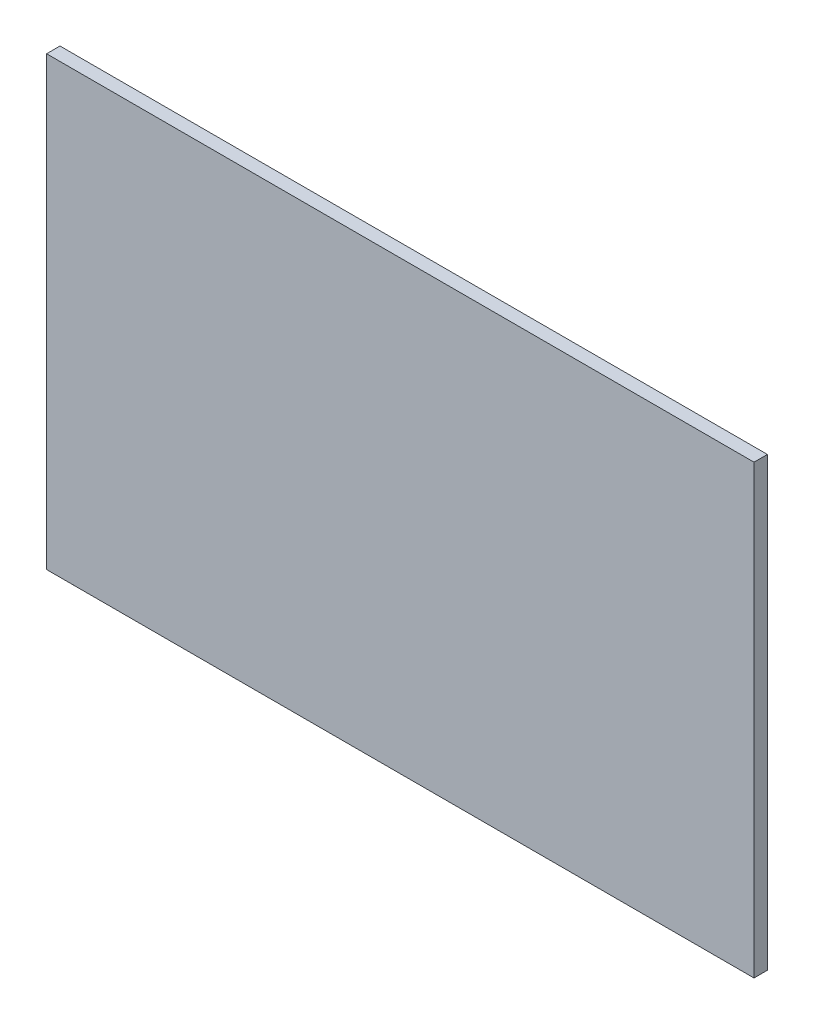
ISO-10303-21;
HEADER;
FILE_DESCRIPTION(('STEP AP214'),'2;1');
FILE_NAME('part.step','',(''),(''),'','','');
FILE_SCHEMA(('AUTOMOTIVE_DESIGN { 1 0 10303 214 1 1 1 1 }'));
ENDSEC;
DATA;
#1=APPLICATION_CONTEXT('core data for automotive mechanical design processes');
#2=APPLICATION_PROTOCOL_DEFINITION('international standard','automotive_design',2000,#1);
#3=PRODUCT_CONTEXT('',#1,'mechanical');
#4=PRODUCT('Part','Part','',(#3));
#5=PRODUCT_RELATED_PRODUCT_CATEGORY('part','',(#4));
#6=PRODUCT_DEFINITION_FORMATION('','',#4);
#7=PRODUCT_DEFINITION_CONTEXT('part definition',#1,'design');
#8=PRODUCT_DEFINITION('design','',#6,#7);
#9=PRODUCT_DEFINITION_SHAPE('','',#8);
#10=(LENGTH_UNIT() NAMED_UNIT(*) SI_UNIT(.MILLI.,.METRE.));
#11=(NAMED_UNIT(*) PLANE_ANGLE_UNIT() SI_UNIT($,.RADIAN.));
#12=(NAMED_UNIT(*) SI_UNIT($,.STERADIAN.) SOLID_ANGLE_UNIT());
#13=UNCERTAINTY_MEASURE_WITH_UNIT(LENGTH_MEASURE(1.E-05),#10,'distance_accuracy_value','');
#14=(GEOMETRIC_REPRESENTATION_CONTEXT(3) GLOBAL_UNCERTAINTY_ASSIGNED_CONTEXT((#13)) GLOBAL_UNIT_ASSIGNED_CONTEXT((#10,
#11,#12)) REPRESENTATION_CONTEXT('',''));
#15=CARTESIAN_POINT('',(0.,0.,0.));
#16=DIRECTION('',(0.,0.,1.));
#17=DIRECTION('',(1.,0.,0.));
#18=AXIS2_PLACEMENT_3D('',#15,#16,#17);
#19=CARTESIAN_POINT('',(79.18,-50.,3.));
#20=DIRECTION('',(-1.,0.,0.));
#21=DIRECTION('',(0.,0.,1.));
#22=AXIS2_PLACEMENT_3D('',#19,#20,#21);
#23=PLANE('',#22);
#24=DIRECTION('',(0.,1.,0.));
#25=VECTOR('',#24,1.);
#26=CARTESIAN_POINT('',(79.18,-50.,0.));
#27=LINE('',#26,#25);
#28=CARTESIAN_POINT('',(79.18,-50.,0.));
#29=VERTEX_POINT('',#28);
#30=CARTESIAN_POINT('',(79.18,50.,0.));
#31=VERTEX_POINT('',#30);
#32=EDGE_CURVE('E119',#29,#31,#27,.T.);
#33=ORIENTED_EDGE('',*,*,#32,.T.);
#34=DIRECTION('',(0.,0.,-1.));
#35=VECTOR('',#34,1.);
#36=CARTESIAN_POINT('',(79.18,50.,3.));
#37=LINE('',#36,#35);
#38=CARTESIAN_POINT('',(79.18,50.,3.));
#39=VERTEX_POINT('',#38);
#40=EDGE_CURVE('E11',#39,#31,#37,.T.);
#41=ORIENTED_EDGE('',*,*,#40,.F.);
#42=DIRECTION('',(0.,1.,0.));
#43=VECTOR('',#42,1.);
#44=CARTESIAN_POINT('',(79.18,-50.,3.));
#45=LINE('',#44,#43);
#46=CARTESIAN_POINT('',(79.18,-50.,3.));
#47=VERTEX_POINT('',#46);
#48=EDGE_CURVE('E103',#47,#39,#45,.T.);
#49=ORIENTED_EDGE('',*,*,#48,.F.);
#50=DIRECTION('',(0.,0.,-1.));
#51=VECTOR('',#50,1.);
#52=CARTESIAN_POINT('',(79.18,-50.,3.));
#53=LINE('',#52,#51);
#54=EDGE_CURVE('E115',#47,#29,#53,.T.);
#55=ORIENTED_EDGE('',*,*,#54,.T.);
#56=EDGE_LOOP('',(#33,#41,#49,#55));
#57=FACE_BOUND('',#56,.T.);
#58=ADVANCED_FACE('F51',(#57),#23,.F.);
#59=CARTESIAN_POINT('',(-79.18,50.,3.));
#60=DIRECTION('',(0.,-1.,0.));
#61=DIRECTION('',(0.,0.,-1.));
#62=AXIS2_PLACEMENT_3D('',#59,#60,#61);
#63=PLANE('',#62);
#64=DIRECTION('',(-1.,0.,0.));
#65=VECTOR('',#64,1.);
#66=CARTESIAN_POINT('',(-79.18,50.,0.));
#67=LINE('',#66,#65);
#68=CARTESIAN_POINT('',(-79.18,50.,0.));
#69=VERTEX_POINT('',#68);
#70=EDGE_CURVE('E108',#31,#69,#67,.T.);
#71=ORIENTED_EDGE('',*,*,#70,.T.);
#72=DIRECTION('',(0.,0.,-1.));
#73=VECTOR('',#72,1.);
#74=CARTESIAN_POINT('',(-79.18,50.,3.));
#75=LINE('',#74,#73);
#76=CARTESIAN_POINT('',(-79.18,50.,3.));
#77=VERTEX_POINT('',#76);
#78=EDGE_CURVE('E60',#77,#69,#75,.T.);
#79=ORIENTED_EDGE('',*,*,#78,.F.);
#80=DIRECTION('',(-1.,0.,0.));
#81=VECTOR('',#80,1.);
#82=CARTESIAN_POINT('',(-79.18,50.,3.));
#83=LINE('',#82,#81);
#84=EDGE_CURVE('E98',#39,#77,#83,.T.);
#85=ORIENTED_EDGE('',*,*,#84,.F.);
#86=ORIENTED_EDGE('',*,*,#40,.T.);
#87=EDGE_LOOP('',(#71,#79,#85,#86));
#88=FACE_BOUND('',#87,.T.);
#89=ADVANCED_FACE('F107',(#88),#63,.F.);
#90=CARTESIAN_POINT('',(-79.18,-50.,3.));
#91=DIRECTION('',(1.,0.,0.));
#92=DIRECTION('',(0.,0.,-1.));
#93=AXIS2_PLACEMENT_3D('',#90,#91,#92);
#94=PLANE('',#93);
#95=DIRECTION('',(0.,-1.,0.));
#96=VECTOR('',#95,1.);
#97=CARTESIAN_POINT('',(-79.18,-50.,0.));
#98=LINE('',#97,#96);
#99=CARTESIAN_POINT('',(-79.18,-50.,0.));
#100=VERTEX_POINT('',#99);
#101=EDGE_CURVE('E85',#69,#100,#98,.T.);
#102=ORIENTED_EDGE('',*,*,#101,.T.);
#103=DIRECTION('',(0.,0.,-1.));
#104=VECTOR('',#103,1.);
#105=CARTESIAN_POINT('',(-79.18,-50.,3.));
#106=LINE('',#105,#104);
#107=CARTESIAN_POINT('',(-79.18,-50.,3.));
#108=VERTEX_POINT('',#107);
#109=EDGE_CURVE('E110',#108,#100,#106,.T.);
#110=ORIENTED_EDGE('',*,*,#109,.F.);
#111=DIRECTION('',(0.,-1.,0.));
#112=VECTOR('',#111,1.);
#113=CARTESIAN_POINT('',(-79.18,-50.,3.));
#114=LINE('',#113,#112);
#115=EDGE_CURVE('E101',#77,#108,#114,.T.);
#116=ORIENTED_EDGE('',*,*,#115,.F.);
#117=ORIENTED_EDGE('',*,*,#78,.T.);
#118=EDGE_LOOP('',(#102,#110,#116,#117));
#119=FACE_BOUND('',#118,.T.);
#120=ADVANCED_FACE('F111',(#119),#94,.F.);
#121=CARTESIAN_POINT('',(-79.18,-50.,3.));
#122=DIRECTION('',(0.,1.,0.));
#123=DIRECTION('',(0.,0.,1.));
#124=AXIS2_PLACEMENT_3D('',#121,#122,#123);
#125=PLANE('',#124);
#126=DIRECTION('',(1.,0.,0.));
#127=VECTOR('',#126,1.);
#128=CARTESIAN_POINT('',(-79.18,-50.,0.));
#129=LINE('',#128,#127);
#130=EDGE_CURVE('E91',#100,#29,#129,.T.);
#131=ORIENTED_EDGE('',*,*,#130,.T.);
#132=ORIENTED_EDGE('',*,*,#54,.F.);
#133=DIRECTION('',(1.,0.,0.));
#134=VECTOR('',#133,1.);
#135=CARTESIAN_POINT('',(-79.18,-50.,3.));
#136=LINE('',#135,#134);
#137=EDGE_CURVE('E68',#108,#47,#136,.T.);
#138=ORIENTED_EDGE('',*,*,#137,.F.);
#139=ORIENTED_EDGE('',*,*,#109,.T.);
#140=EDGE_LOOP('',(#131,#132,#138,#139));
#141=FACE_BOUND('',#140,.T.);
#142=ADVANCED_FACE('F132',(#141),#125,.F.);
#143=CARTESIAN_POINT('',(0.,0.,3.));
#144=DIRECTION('',(0.,0.,-1.));
#145=DIRECTION('',(-1.,0.,0.));
#146=AXIS2_PLACEMENT_3D('',#143,#144,#145);
#147=PLANE('',#146);
#148=ORIENTED_EDGE('',*,*,#48,.T.);
#149=ORIENTED_EDGE('',*,*,#84,.T.);
#150=ORIENTED_EDGE('',*,*,#115,.T.);
#151=ORIENTED_EDGE('',*,*,#137,.T.);
#152=EDGE_LOOP('',(#148,#149,#150,#151));
#153=FACE_BOUND('',#152,.T.);
#154=ADVANCED_FACE('F99',(#153),#147,.F.);
#155=CARTESIAN_POINT('',(0.,0.,0.));
#156=DIRECTION('',(0.,0.,-1.));
#157=DIRECTION('',(-1.,0.,0.));
#158=AXIS2_PLACEMENT_3D('',#155,#156,#157);
#159=PLANE('',#158);
#160=ORIENTED_EDGE('',*,*,#32,.F.);
#161=ORIENTED_EDGE('',*,*,#130,.F.);
#162=ORIENTED_EDGE('',*,*,#101,.F.);
#163=ORIENTED_EDGE('',*,*,#70,.F.);
#164=EDGE_LOOP('',(#160,#161,#162,#163));
#165=FACE_BOUND('',#164,.T.);
#166=ADVANCED_FACE('F135',(#165),#159,.T.);
#167=CLOSED_SHELL('',(#58,#89,#120,#142,#154,#166));
#168=MANIFOLD_SOLID_BREP('B2',#167);
#169=ADVANCED_BREP_SHAPE_REPRESENTATION('',(#18,#168),#14);
#170=SHAPE_DEFINITION_REPRESENTATION(#9,#169);
ENDSEC;
END-ISO-10303-21;
